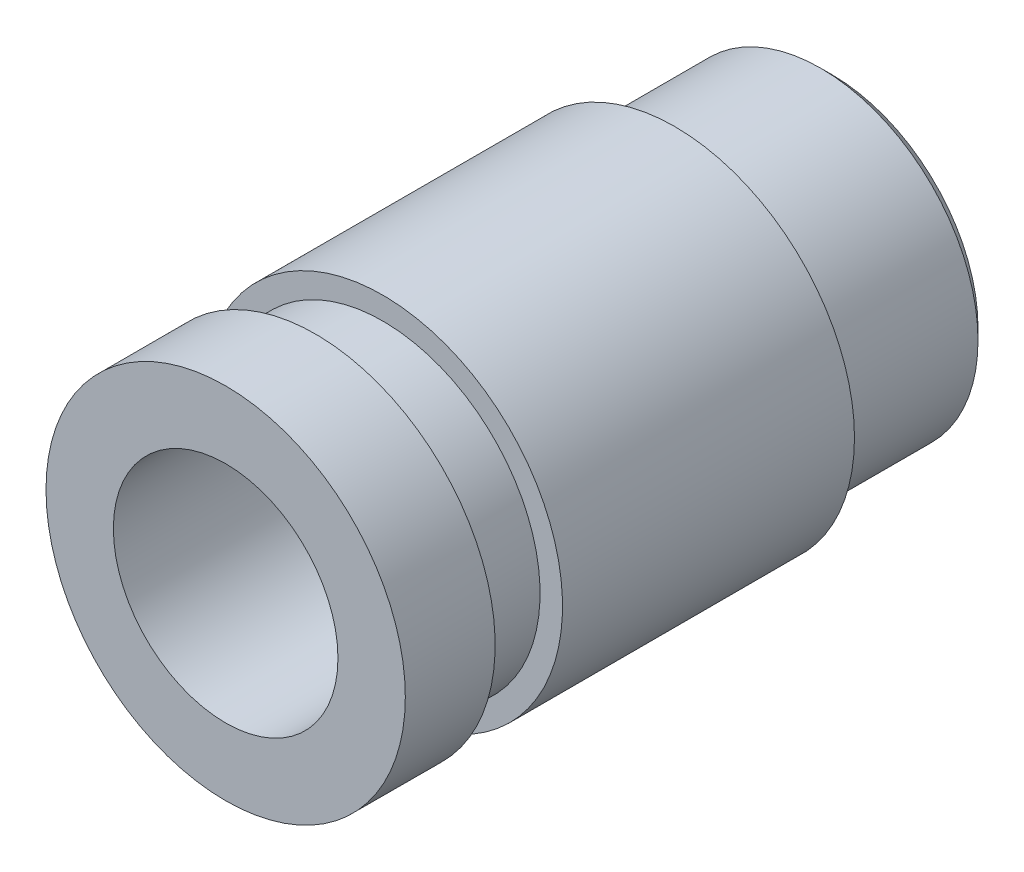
from build123d import *

# Parameters (mm, degrees)
ESQUISSE1_R             = 4
BOSS_EXTRU_1_DEPTH      = 10
ESQUISSE2_R             = 3.5
BOSS_EXTRU_2_DEPTH      = 3.5
CHANFREIN1_SIZE         = 0.25
ENL_V_MAT_EXTRU_1_REACH = 16.637
ESQUISSE3_R             = 2.5
ESQUISSE5_W             = 1.5
ESQUISSE5_H             = 0.5


with BuildPart() as part:
    # Esquisse1 → Boss.-Extru.1 (new body)
    with BuildSketch(Plane.XY):
        Circle(ESQUISSE1_R)
    extrude(amount=BOSS_EXTRU_1_DEPTH)

    # Esquisse2 → Boss.-Extru.2 (add)
    with BuildSketch(Plane(origin=(0, 0, 0), x_dir=(-1, 0, 0), z_dir=(0, 0, -1))):
        with Locations(Location((0, 0, 0), (0, 0, 180))):
            Circle(ESQUISSE2_R)
    extrude(amount=BOSS_EXTRU_2_DEPTH)

    # Chanfrein1
    chanfrein1_edges = [part.edges().sort_by_distance(p)[0] for p in [
        (-3.5, 0, -3.5),
    ]]
    chamfer(chanfrein1_edges, length=CHANFREIN1_SIZE)

    # Esquisse3 → Enl_v. mat.-Extru.1 (cut, up to next)
    with BuildSketch(Plane(origin=(0, 0, -3.5), x_dir=(-1, 0, 0), z_dir=(0, 0, -1)), mode=Mode.PRIVATE) as enl_v_mat_extru_1_sk1:
        Circle(ESQUISSE3_R)
    enl_v_mat_extru_1_tool1 = extrude(enl_v_mat_extru_1_sk1.sketch, amount=-ENL_V_MAT_EXTRU_1_REACH, mode=Mode.PRIVATE) & part.part
    add(enl_v_mat_extru_1_tool1.solids().sort_by_distance((0, 0, -3.5))[0], mode=Mode.SUBTRACT)

    # Esquisse5 → Enl_vement de mati_re-R_volution1 (revolve, cut)
    with BuildSketch(Plane(origin=(0, 0, 0), x_dir=(0, 0, -1), z_dir=(1, 0, 0)), mode=Mode.PRIVATE) as enl_vement_de_mati_re_r_volution1_sk:
        with Locations((-7.25, 3.75)):
            Rectangle(ESQUISSE5_W, ESQUISSE5_H)
    revolve(enl_vement_de_mati_re_r_volution1_sk.sketch.rotate(Axis((0, 0, 0), (0, 0, 1)), 90), axis=Axis((0, 0, 0), (0, 0, 1)), mode=Mode.SUBTRACT)


solid = part.part
